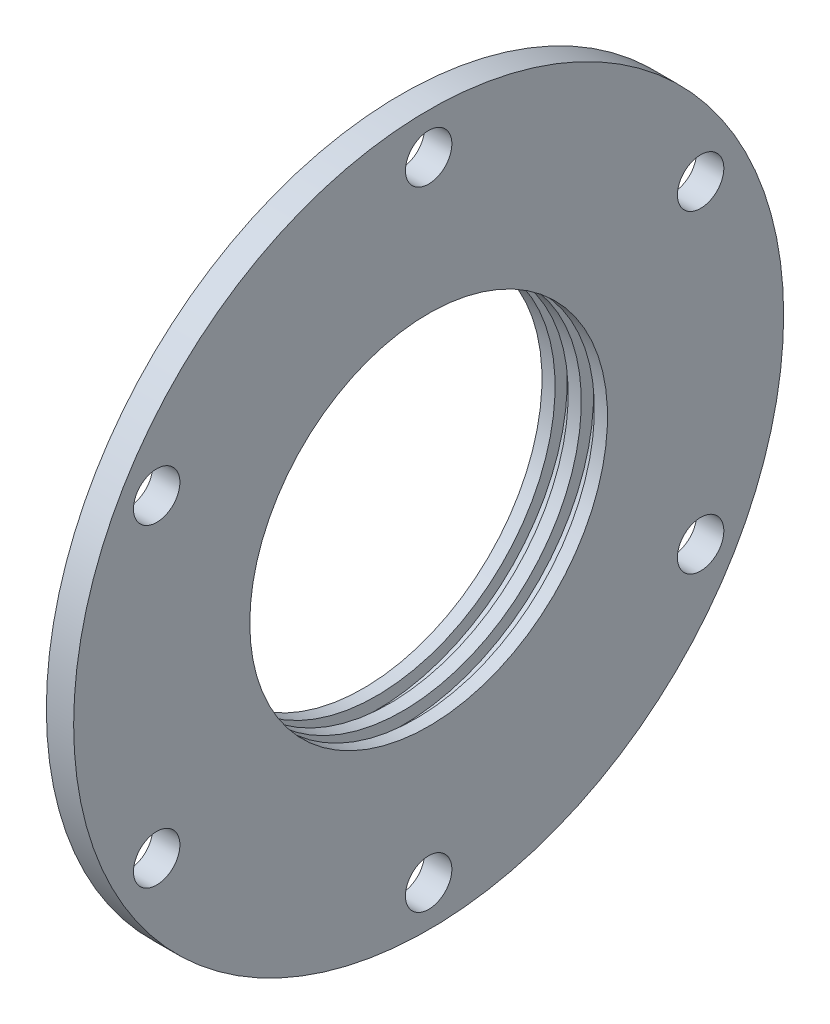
from build123d import *

# Parameters (mm, degrees)
ESQUISSE2_R                  = 4.25
ENL_V_MAT_EXTRU_1_DEPTH      = 93.703829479
R_P_TITION_CIRCULAIRE1_COUNT = 6
CHANFREIN1_SIZE              = 2
CHANFREIN1_SIZE2             = 1.154700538


with BuildPart() as part:
    # Esquisse1 → R_volution1 (revolve)
    with BuildSketch(Plane.XY, mode=Mode.PRIVATE) as r_volution1_sk:
        Polygon((-7, 42.5), (0, 42.5), (0, 65), (5, 65), (5, 32.75), (2.6, 32.75), (2.6, 35), (0.2, 35), (0.2, 32.75), (-2.2, 32.75), (-2.2, 35), (-4.6, 35), (-4.6, 32.75), (-7, 32.75), (-7, 39), align=None)
    revolve(r_volution1_sk.sketch.rotate(Axis((-15.101172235, 0, 0), (1, 0, 0)), 90), axis=Axis((-15.101172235, 0, 0), (1, 0, 0)))

    # Esquisse2 → Enl_v. mat.-Extru.1 (cut, through all)
    with BuildSketch(Plane(origin=(5, 0, 0), x_dir=(0, 0, -1), z_dir=(1, 0, 0))):
        with Locations((0, 57.5)):
            Circle(ESQUISSE2_R)
    enl_v_mat_extru_1 = extrude(amount=-ENL_V_MAT_EXTRU_1_DEPTH, mode=Mode.SUBTRACT)

    # R_p_tition circulaire1: Enl_v. mat.-Extru.1 ×6 about axis
    r_p_tition_circulaire1_axis = Axis((0, 0, 0), (1, 0, 0))
    for i in range(1, R_P_TITION_CIRCULAIRE1_COUNT):
        add(enl_v_mat_extru_1.rotate(r_p_tition_circulaire1_axis, i * 360 / R_P_TITION_CIRCULAIRE1_COUNT), mode=Mode.SUBTRACT)

    # Chanfrein1
    chanfrein1_edges = [part.edges().sort_by_distance(p)[0] for p in [
        (-7, 0, -42.5),
    ]]
    chanfrein1_side = [part.faces().sort_by_distance(p)[0] for p in [
        (-3.5, 0, -42.5),
    ]]
    chamfer(chanfrein1_edges, length=CHANFREIN1_SIZE, length2=CHANFREIN1_SIZE2, reference=chanfrein1_side[0])


solid = part.part
